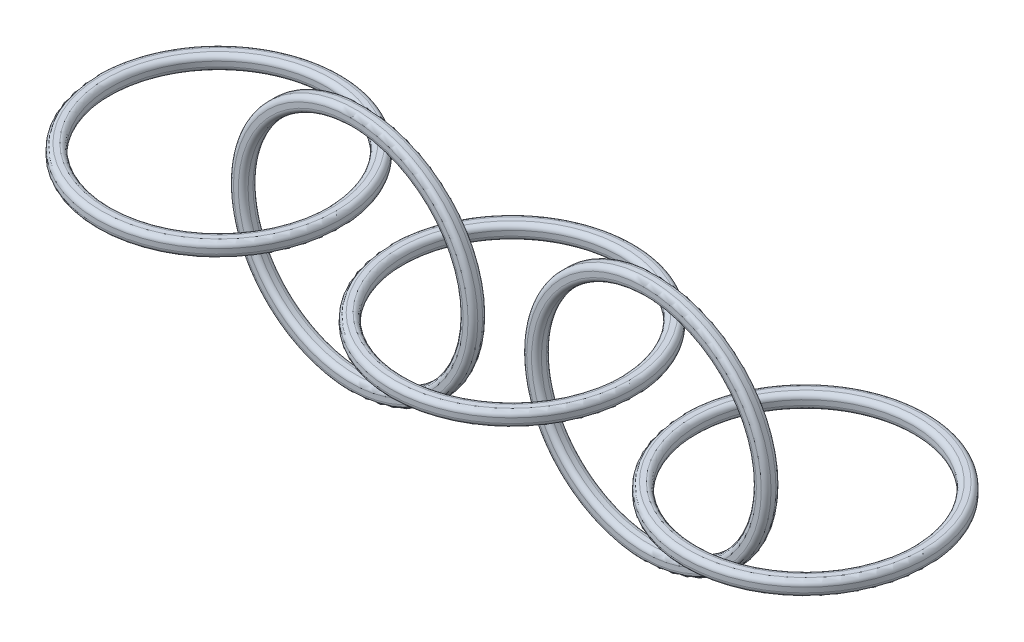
from build123d import *

# Parameters (mm, degrees)
SKETCH1_R           = 25
SKETCH1_R_2         = 22
BOSS_EXTRUDE1_DEPTH = 3
SKETCH5_R           = 25
SKETCH5_R_2         = 22
BOSS_EXTRUDE5_DEPTH = 3
SKETCH6_R           = 25
SKETCH6_R_2         = 22
BOSS_EXTRUDE6_DEPTH = 3
SKETCH7_R           = 25
SKETCH7_R_2         = 22
BOSS_EXTRUDE7_DEPTH = 3
SKETCH8_R           = 25
SKETCH8_R_2         = 22
BOSS_EXTRUDE8_DEPTH = 3
FILLET1_R           = 1
FILLET2_R           = 1
FILLET3_R           = 1
FILLET4_R           = 1
FILLET5_R           = 1
FILLET6_R           = 1
FILLET7_R           = 1
FILLET8_R           = 1
FILLET9_R           = 1
FILLET10_R          = 1
FILLET11_R          = 1
FILLET12_R          = 1
FILLET13_R          = 1
FILLET14_R          = 1
FILLET15_R          = 1
FILLET16_R          = 1
FILLET17_R          = 1
FILLET18_R          = 1
FILLET19_R          = 1
FILLET20_R          = 1


with BuildPart() as part:
    # Sketch1 → Boss-Extrude1 (new body)
    with BuildSketch(Plane(origin=(0, 0, 0), x_dir=(1, 0, 0), z_dir=(0, 1, 0))):
        with Locations(Location((0, 0, 0), (0, 0, 270))):
            Circle(SKETCH1_R)
        with Locations(Location((0, 0, 0), (0, 0, 270))):
            Circle(SKETCH1_R_2, mode=Mode.SUBTRACT)
    extrude(amount=BOSS_EXTRUDE1_DEPTH)

    # Fillet17
    fillet17_edges = [part.edges().sort_by_distance(p)[0] for p in [
        (0, 3, -22),
    ]]
    fillet(fillet17_edges, radius=FILLET17_R)

    # Fillet18
    fillet18_edges = [part.edges().sort_by_distance(p)[0] for p in [
        (0, 3, -25),
    ]]
    fillet(fillet18_edges, radius=FILLET18_R)

    # Fillet19
    fillet19_edges = [part.edges().sort_by_distance(p)[0] for p in [
        (0, 0, -25),
    ]]
    fillet(fillet19_edges, radius=FILLET19_R)

    # Fillet20
    fillet20_edges = [part.edges().sort_by_distance(p)[0] for p in [
        (0, 0, -22),
    ]]
    fillet(fillet20_edges, radius=FILLET20_R)


with BuildPart() as body_2:
    # Sketch5 → Boss-Extrude5 (new body)
    with BuildSketch(Plane(origin=(0, 0, 0), x_dir=(1, 0, 0), z_dir=(0, 1, 0))):
        with Locations(Location((-60, 0, 0), (0, 0, 270))):
            Circle(SKETCH5_R)
        with Locations(Location((-60, 0, 0), (0, 0, 270))):
            Circle(SKETCH5_R_2, mode=Mode.SUBTRACT)
    extrude(amount=BOSS_EXTRUDE5_DEPTH)

    # Fillet9
    fillet9_edges = [body_2.edges().sort_by_distance(p)[0] for p in [
        (-60, 3, -22),
    ]]
    fillet(fillet9_edges, radius=FILLET9_R)

    # Fillet10
    fillet10_edges = [body_2.edges().sort_by_distance(p)[0] for p in [
        (-60, 3, -25),
    ]]
    fillet(fillet10_edges, radius=FILLET10_R)

    # Fillet11
    fillet11_edges = [body_2.edges().sort_by_distance(p)[0] for p in [
        (-60, 0, -25),
    ]]
    fillet(fillet11_edges, radius=FILLET11_R)

    # Fillet12
    fillet12_edges = [body_2.edges().sort_by_distance(p)[0] for p in [
        (-60, 0, -22),
    ]]
    fillet(fillet12_edges, radius=FILLET12_R)


with BuildPart() as body_3:
    # Sketch6 → Boss-Extrude6 (new body)
    with BuildSketch(Plane(origin=(0, 0, 0), x_dir=(1, 0, 0), z_dir=(0, 1, 0))):
        with Locations(Location((-120, 0, 0), (0, 0, 270))):
            Circle(SKETCH6_R)
        with Locations(Location((-120, 0, 0), (0, 0, 270))):
            Circle(SKETCH6_R_2, mode=Mode.SUBTRACT)
    extrude(amount=BOSS_EXTRUDE6_DEPTH)

    # Fillet1
    fillet1_edges = [body_3.edges().sort_by_distance(p)[0] for p in [
        (-120, 3, -22),
    ]]
    fillet(fillet1_edges, radius=FILLET1_R)

    # Fillet2
    fillet2_edges = [body_3.edges().sort_by_distance(p)[0] for p in [
        (-120, 3, -25),
    ]]
    fillet(fillet2_edges, radius=FILLET2_R)

    # Fillet3
    fillet3_edges = [body_3.edges().sort_by_distance(p)[0] for p in [
        (-120, 0, -25),
    ]]
    fillet(fillet3_edges, radius=FILLET3_R)

    # Fillet4
    fillet4_edges = [body_3.edges().sort_by_distance(p)[0] for p in [
        (-120, 0, -22),
    ]]
    fillet(fillet4_edges, radius=FILLET4_R)


with BuildPart() as body_4:
    # Sketch7 → Boss-Extrude7 (new body)
    with BuildSketch(Plane.XY):
        with Locations((-90, 0)):
            Circle(SKETCH7_R)
        with Locations((-90, 0)):
            Circle(SKETCH7_R_2, mode=Mode.SUBTRACT)
    extrude(amount=BOSS_EXTRUDE7_DEPTH)

    # Fillet5
    fillet5_edges = [body_4.edges().sort_by_distance(p)[0] for p in [
        (-115, 0, 3),
    ]]
    fillet(fillet5_edges, radius=FILLET5_R)

    # Fillet6
    fillet6_edges = [body_4.edges().sort_by_distance(p)[0] for p in [
        (-115, 0, 0),
    ]]
    fillet(fillet6_edges, radius=FILLET6_R)

    # Fillet7
    fillet7_edges = [body_4.edges().sort_by_distance(p)[0] for p in [
        (-112, 0, 0),
    ]]
    fillet(fillet7_edges, radius=FILLET7_R)

    # Fillet8
    fillet8_edges = [body_4.edges().sort_by_distance(p)[0] for p in [
        (-112, 0, 3),
    ]]
    fillet(fillet8_edges, radius=FILLET8_R)


with BuildPart() as body_5:
    # Sketch8 → Boss-Extrude8 (new body)
    with BuildSketch(Plane.XY):
        with Locations((-30, 0)):
            Circle(SKETCH8_R)
        with Locations((-30, 0)):
            Circle(SKETCH8_R_2, mode=Mode.SUBTRACT)
    extrude(amount=BOSS_EXTRUDE8_DEPTH)

    # Fillet13
    fillet13_edges = [body_5.edges().sort_by_distance(p)[0] for p in [
        (-52, 0, 3),
    ]]
    fillet(fillet13_edges, radius=FILLET13_R)

    # Fillet14
    fillet14_edges = [body_5.edges().sort_by_distance(p)[0] for p in [
        (-55, 0, 3),
    ]]
    fillet(fillet14_edges, radius=FILLET14_R)

    # Fillet15
    fillet15_edges = [body_5.edges().sort_by_distance(p)[0] for p in [
        (-55, 0, 0),
    ]]
    fillet(fillet15_edges, radius=FILLET15_R)

    # Fillet16
    fillet16_edges = [body_5.edges().sort_by_distance(p)[0] for p in [
        (-52, 0, 0),
    ]]
    fillet(fillet16_edges, radius=FILLET16_R)


solid = Compound([part.part, body_2.part, body_3.part, body_4.part, body_5.part])
